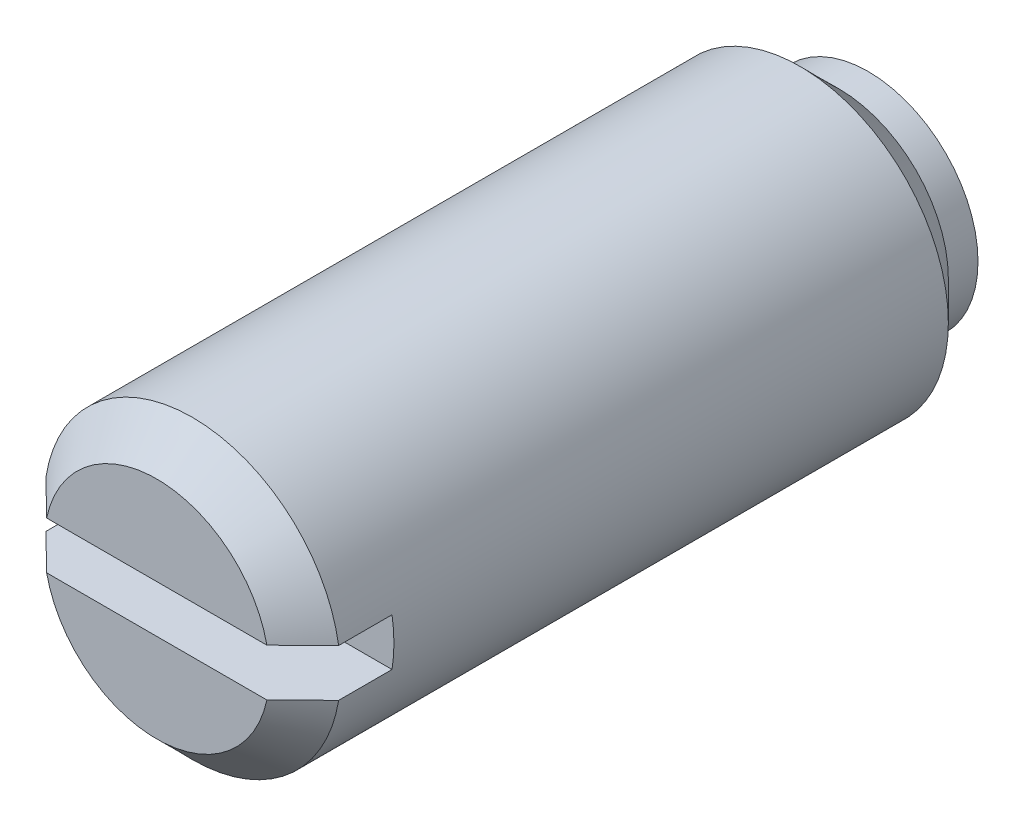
ISO-10303-21;
HEADER;
FILE_DESCRIPTION(('STEP AP214'),'2;1');
FILE_NAME('part.step','',(''),(''),'','','');
FILE_SCHEMA(('AUTOMOTIVE_DESIGN { 1 0 10303 214 1 1 1 1 }'));
ENDSEC;
DATA;
#1=APPLICATION_CONTEXT('core data for automotive mechanical design processes');
#2=APPLICATION_PROTOCOL_DEFINITION('international standard','automotive_design',2000,#1);
#3=PRODUCT_CONTEXT('',#1,'mechanical');
#4=PRODUCT('Part','Part','',(#3));
#5=PRODUCT_RELATED_PRODUCT_CATEGORY('part','',(#4));
#6=PRODUCT_DEFINITION_FORMATION('','',#4);
#7=PRODUCT_DEFINITION_CONTEXT('part definition',#1,'design');
#8=PRODUCT_DEFINITION('design','',#6,#7);
#9=PRODUCT_DEFINITION_SHAPE('','',#8);
#10=(LENGTH_UNIT() NAMED_UNIT(*) SI_UNIT(.MILLI.,.METRE.));
#11=(NAMED_UNIT(*) PLANE_ANGLE_UNIT() SI_UNIT($,.RADIAN.));
#12=(NAMED_UNIT(*) SI_UNIT($,.STERADIAN.) SOLID_ANGLE_UNIT());
#13=UNCERTAINTY_MEASURE_WITH_UNIT(LENGTH_MEASURE(1.E-05),#10,'distance_accuracy_value','');
#14=(GEOMETRIC_REPRESENTATION_CONTEXT(3) GLOBAL_UNCERTAINTY_ASSIGNED_CONTEXT((#13)) GLOBAL_UNIT_ASSIGNED_CONTEXT((#10,
#11,#12)) REPRESENTATION_CONTEXT('',''));
#15=CARTESIAN_POINT('',(0.,0.,0.));
#16=DIRECTION('',(0.,0.,1.));
#17=DIRECTION('',(1.,0.,0.));
#18=AXIS2_PLACEMENT_3D('',#15,#16,#17);
#19=CARTESIAN_POINT('',(0.,0.,-7.1));
#20=DIRECTION('',(0.,0.,-1.));
#21=DIRECTION('',(-1.,0.,0.));
#22=AXIS2_PLACEMENT_3D('',#19,#20,#21);
#23=CYLINDRICAL_SURFACE('',#22,2.5);
#24=CARTESIAN_POINT('',(0.,0.,11.4));
#25=DIRECTION('',(0.,0.,1.));
#26=DIRECTION('',(1.,0.,0.));
#27=AXIS2_PLACEMENT_3D('',#24,#25,#26);
#28=CIRCLE('',#27,2.5);
#29=CARTESIAN_POINT('',(-2.46779253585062,0.4,11.4));
#30=VERTEX_POINT('',#29);
#31=CARTESIAN_POINT('',(-2.46779253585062,-0.4,11.4));
#32=VERTEX_POINT('',#31);
#33=EDGE_CURVE('E70',#30,#32,#28,.T.);
#34=ORIENTED_EDGE('',*,*,#33,.F.);
#35=DIRECTION('',(0.,0.,1.));
#36=VECTOR('',#35,1.);
#37=CARTESIAN_POINT('',(-2.46779253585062,0.4,10.9));
#38=LINE('',#37,#36);
#39=CARTESIAN_POINT('',(-2.46779253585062,0.4,12.3));
#40=VERTEX_POINT('',#39);
#41=EDGE_CURVE('E30',#30,#40,#38,.T.);
#42=ORIENTED_EDGE('',*,*,#41,.T.);
#43=CARTESIAN_POINT('',(0.,0.,12.3));
#44=DIRECTION('',(0.,0.,1.));
#45=DIRECTION('',(1.,0.,0.));
#46=AXIS2_PLACEMENT_3D('',#43,#44,#45);
#47=CIRCLE('',#46,2.5);
#48=CARTESIAN_POINT('',(2.46779253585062,0.4,12.3));
#49=VERTEX_POINT('',#48);
#50=EDGE_CURVE('E67',#40,#49,#47,.F.);
#51=ORIENTED_EDGE('',*,*,#50,.T.);
#52=DIRECTION('',(0.,0.,1.));
#53=VECTOR('',#52,1.);
#54=CARTESIAN_POINT('',(2.46779253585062,0.4,10.9));
#55=LINE('',#54,#53);
#56=CARTESIAN_POINT('',(2.46779253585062,0.4,11.4));
#57=VERTEX_POINT('',#56);
#58=EDGE_CURVE('E72',#57,#49,#55,.T.);
#59=ORIENTED_EDGE('',*,*,#58,.F.);
#60=CARTESIAN_POINT('',(0.,0.,11.4));
#61=DIRECTION('',(0.,0.,1.));
#62=DIRECTION('',(1.,0.,0.));
#63=AXIS2_PLACEMENT_3D('',#60,#61,#62);
#64=CIRCLE('',#63,2.5);
#65=CARTESIAN_POINT('',(2.46779253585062,-0.4,11.4));
#66=VERTEX_POINT('',#65);
#67=EDGE_CURVE('E149',#66,#57,#64,.T.);
#68=ORIENTED_EDGE('',*,*,#67,.F.);
#69=DIRECTION('',(0.,0.,1.));
#70=VECTOR('',#69,1.);
#71=CARTESIAN_POINT('',(2.46779253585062,-0.4,10.9));
#72=LINE('',#71,#70);
#73=CARTESIAN_POINT('',(2.46779253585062,-0.4,12.3));
#74=VERTEX_POINT('',#73);
#75=EDGE_CURVE('E138',#66,#74,#72,.T.);
#76=ORIENTED_EDGE('',*,*,#75,.T.);
#77=CARTESIAN_POINT('',(0.,0.,12.3));
#78=DIRECTION('',(0.,0.,1.));
#79=DIRECTION('',(1.,0.,0.));
#80=AXIS2_PLACEMENT_3D('',#77,#78,#79);
#81=CIRCLE('',#80,2.5);
#82=CARTESIAN_POINT('',(-2.46779253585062,-0.4,12.3));
#83=VERTEX_POINT('',#82);
#84=EDGE_CURVE('E85',#74,#83,#81,.F.);
#85=ORIENTED_EDGE('',*,*,#84,.T.);
#86=DIRECTION('',(0.,0.,1.));
#87=VECTOR('',#86,1.);
#88=CARTESIAN_POINT('',(-2.46779253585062,-0.4,10.9));
#89=LINE('',#88,#87);
#90=EDGE_CURVE('E135',#32,#83,#89,.T.);
#91=ORIENTED_EDGE('',*,*,#90,.F.);
#92=EDGE_LOOP('',(#34,#42,#51,#59,#68,#76,#85,#91));
#93=FACE_BOUND('',#92,.T.);
#94=CARTESIAN_POINT('',(0.,0.,2.05));
#95=DIRECTION('',(0.,0.,1.));
#96=DIRECTION('',(1.,0.,0.));
#97=AXIS2_PLACEMENT_3D('',#94,#95,#96);
#98=CIRCLE('',#97,2.5);
#99=CARTESIAN_POINT('',(2.5,0.,2.05));
#100=VERTEX_POINT('',#99);
#101=EDGE_CURVE('E262',#100,#100,#98,.T.);
#102=ORIENTED_EDGE('',*,*,#101,.T.);
#103=EDGE_LOOP('',(#102));
#104=FACE_BOUND('',#103,.T.);
#105=ADVANCED_FACE('F14',(#93,#104),#23,.T.);
#106=CARTESIAN_POINT('',(0.,2.5,12.9));
#107=DIRECTION('',(0.,0.,1.));
#108=DIRECTION('',(1.,0.,0.));
#109=AXIS2_PLACEMENT_3D('',#106,#107,#108);
#110=PLANE('',#109);
#111=DIRECTION('',(1.,0.,0.));
#112=VECTOR('',#111,1.);
#113=CARTESIAN_POINT('',(-2.46779253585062,0.4,12.9));
#114=LINE('',#113,#112);
#115=CARTESIAN_POINT('',(-1.85741756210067,0.4,12.9));
#116=VERTEX_POINT('',#115);
#117=CARTESIAN_POINT('',(1.85741756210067,0.4,12.9));
#118=VERTEX_POINT('',#117);
#119=EDGE_CURVE('E79',#116,#118,#114,.T.);
#120=ORIENTED_EDGE('',*,*,#119,.T.);
#121=CARTESIAN_POINT('',(0.,0.,12.9));
#122=DIRECTION('',(0.,0.,1.));
#123=DIRECTION('',(1.,0.,0.));
#124=AXIS2_PLACEMENT_3D('',#121,#122,#123);
#125=CIRCLE('',#124,1.9);
#126=EDGE_CURVE('E9',#118,#116,#125,.T.);
#127=ORIENTED_EDGE('',*,*,#126,.T.);
#128=EDGE_LOOP('',(#120,#127));
#129=FACE_BOUND('',#128,.T.);
#130=ADVANCED_FACE('F134',(#129),#110,.T.);
#131=DIRECTION('',(1.,0.,0.));
#132=VECTOR('',#131,1.);
#133=CARTESIAN_POINT('',(-2.46779253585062,-0.4,12.9));
#134=LINE('',#133,#132);
#135=CARTESIAN_POINT('',(-1.85741756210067,-0.4,12.9));
#136=VERTEX_POINT('',#135);
#137=CARTESIAN_POINT('',(1.85741756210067,-0.4,12.9));
#138=VERTEX_POINT('',#137);
#139=EDGE_CURVE('E136',#136,#138,#134,.T.);
#140=ORIENTED_EDGE('',*,*,#139,.F.);
#141=CARTESIAN_POINT('',(0.,0.,12.9));
#142=DIRECTION('',(0.,0.,1.));
#143=DIRECTION('',(1.,0.,0.));
#144=AXIS2_PLACEMENT_3D('',#141,#142,#143);
#145=CIRCLE('',#144,1.9);
#146=EDGE_CURVE('E82',#136,#138,#145,.T.);
#147=ORIENTED_EDGE('',*,*,#146,.T.);
#148=EDGE_LOOP('',(#140,#147));
#149=FACE_BOUND('',#148,.T.);
#150=ADVANCED_FACE('F121',(#149),#110,.T.);
#151=CARTESIAN_POINT('',(-2.46779253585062,0.4,10.9));
#152=DIRECTION('',(0.,-1.,0.));
#153=DIRECTION('',(1.,0.,0.));
#154=AXIS2_PLACEMENT_3D('',#151,#152,#153);
#155=PLANE('',#154);
#156=DIRECTION('',(-1.,0.,0.));
#157=VECTOR('',#156,1.);
#158=CARTESIAN_POINT('',(2.46779253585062,0.4,11.4));
#159=LINE('',#158,#157);
#160=EDGE_CURVE('E34',#57,#30,#159,.T.);
#161=ORIENTED_EDGE('',*,*,#160,.F.);
#162=ORIENTED_EDGE('',*,*,#58,.T.);
#163=CARTESIAN_POINT('',(2.46779253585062,0.4,12.3));
#164=CARTESIAN_POINT('',(2.41703205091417,0.4,12.3501058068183));
#165=CARTESIAN_POINT('',(2.36625249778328,0.4,12.400192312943));
#166=CARTESIAN_POINT('',(2.26464552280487,0.4,12.5003166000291));
#167=CARTESIAN_POINT('',(2.21381810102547,0.4,12.5503543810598));
#168=CARTESIAN_POINT('',(2.11210548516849,0.4,12.650371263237));
#169=CARTESIAN_POINT('',(2.0612202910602,0.4,12.7003503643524));
#170=CARTESIAN_POINT('',(1.95937717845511,0.4,12.8002345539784));
#171=CARTESIAN_POINT('',(1.90841925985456,0.4,12.8501396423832));
#172=CARTESIAN_POINT('',(1.85741756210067,0.4,12.9));
#173=B_SPLINE_CURVE_WITH_KNOTS('',3,(#163,#164,#165,#166,#167,#168,#169,#170,#171,#172),
.UNSPECIFIED.,.F.,.F.,(4,2,2,2,4),(0.,0.213974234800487,0.42794816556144,0.641922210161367,
0.855896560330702),.UNSPECIFIED.);
#174=EDGE_CURVE('E23',#49,#118,#173,.T.);
#175=ORIENTED_EDGE('',*,*,#174,.T.);
#176=ORIENTED_EDGE('',*,*,#119,.F.);
#177=CARTESIAN_POINT('',(-1.85741756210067,0.4,12.9));
#178=CARTESIAN_POINT('',(-1.90841925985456,0.4,12.8501396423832));
#179=CARTESIAN_POINT('',(-1.95937717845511,0.4,12.8002345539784));
#180=CARTESIAN_POINT('',(-2.0612202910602,0.4,12.7003503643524));
#181=CARTESIAN_POINT('',(-2.11210548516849,0.4,12.650371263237));
#182=CARTESIAN_POINT('',(-2.21381810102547,0.4,12.5503543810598));
#183=CARTESIAN_POINT('',(-2.26464552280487,0.4,12.5003166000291));
#184=CARTESIAN_POINT('',(-2.36625249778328,0.4,12.400192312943));
#185=CARTESIAN_POINT('',(-2.41703205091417,0.4,12.3501058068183));
#186=CARTESIAN_POINT('',(-2.46779253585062,0.4,12.3));
#187=B_SPLINE_CURVE_WITH_KNOTS('',3,(#177,#178,#179,#180,#181,#182,#183,#184,#185,#186),
.UNSPECIFIED.,.F.,.F.,(4,2,2,2,4),(0.,0.213974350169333,0.427948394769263,0.641922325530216,
0.855896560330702),.UNSPECIFIED.);
#188=EDGE_CURVE('E76',#116,#40,#187,.T.);
#189=ORIENTED_EDGE('',*,*,#188,.T.);
#190=ORIENTED_EDGE('',*,*,#41,.F.);
#191=EDGE_LOOP('',(#161,#162,#175,#176,#189,#190));
#192=FACE_BOUND('',#191,.T.);
#193=ADVANCED_FACE('F77',(#192),#155,.T.);
#194=CARTESIAN_POINT('',(-2.46779253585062,-0.4,10.9));
#195=DIRECTION('',(0.,-1.,0.));
#196=DIRECTION('',(1.,0.,0.));
#197=AXIS2_PLACEMENT_3D('',#194,#195,#196);
#198=PLANE('',#197);
#199=ORIENTED_EDGE('',*,*,#75,.F.);
#200=DIRECTION('',(1.,0.,0.));
#201=VECTOR('',#200,1.);
#202=CARTESIAN_POINT('',(-2.46779253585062,-0.4,11.4));
#203=LINE('',#202,#201);
#204=EDGE_CURVE('E256',#32,#66,#203,.T.);
#205=ORIENTED_EDGE('',*,*,#204,.F.);
#206=ORIENTED_EDGE('',*,*,#90,.T.);
#207=CARTESIAN_POINT('',(-2.46779253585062,-0.4,12.3));
#208=CARTESIAN_POINT('',(-2.41703205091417,-0.4,12.3501058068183));
#209=CARTESIAN_POINT('',(-2.36625249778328,-0.4,12.400192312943));
#210=CARTESIAN_POINT('',(-2.26464552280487,-0.4,12.5003166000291));
#211=CARTESIAN_POINT('',(-2.21381810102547,-0.4,12.5503543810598));
#212=CARTESIAN_POINT('',(-2.11210548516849,-0.4,12.650371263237));
#213=CARTESIAN_POINT('',(-2.0612202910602,-0.4,12.7003503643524));
#214=CARTESIAN_POINT('',(-1.95937717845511,-0.4,12.8002345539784));
#215=CARTESIAN_POINT('',(-1.90841925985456,-0.4,12.8501396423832));
#216=CARTESIAN_POINT('',(-1.85741756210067,-0.4,12.9));
#217=B_SPLINE_CURVE_WITH_KNOTS('',3,(#207,#208,#209,#210,#211,#212,#213,#214,#215,#216),
.UNSPECIFIED.,.F.,.F.,(4,2,2,2,4),(0.,0.213974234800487,0.42794816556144,0.641922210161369,
0.855896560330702),.UNSPECIFIED.);
#218=EDGE_CURVE('E100',#83,#136,#217,.T.);
#219=ORIENTED_EDGE('',*,*,#218,.T.);
#220=ORIENTED_EDGE('',*,*,#139,.T.);
#221=CARTESIAN_POINT('',(1.85741756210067,-0.4,12.9));
#222=CARTESIAN_POINT('',(1.90841925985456,-0.4,12.8501396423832));
#223=CARTESIAN_POINT('',(1.95937717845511,-0.4,12.8002345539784));
#224=CARTESIAN_POINT('',(2.0612202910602,-0.4,12.7003503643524));
#225=CARTESIAN_POINT('',(2.11210548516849,-0.4,12.650371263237));
#226=CARTESIAN_POINT('',(2.21381810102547,-0.4,12.5503543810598));
#227=CARTESIAN_POINT('',(2.26464552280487,-0.4,12.5003166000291));
#228=CARTESIAN_POINT('',(2.36625249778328,-0.4,12.400192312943));
#229=CARTESIAN_POINT('',(2.41703205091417,-0.4,12.3501058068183));
#230=CARTESIAN_POINT('',(2.46779253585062,-0.4,12.3));
#231=B_SPLINE_CURVE_WITH_KNOTS('',3,(#221,#222,#223,#224,#225,#226,#227,#228,#229,#230),
.UNSPECIFIED.,.F.,.F.,(4,2,2,2,4),(0.,0.213974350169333,0.427948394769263,0.641922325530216,
0.855896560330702),.UNSPECIFIED.);
#232=EDGE_CURVE('E88',#138,#74,#231,.T.);
#233=ORIENTED_EDGE('',*,*,#232,.T.);
#234=EDGE_LOOP('',(#199,#205,#206,#219,#220,#233));
#235=FACE_BOUND('',#234,.T.);
#236=ADVANCED_FACE('F109',(#235),#198,.F.);
#237=CARTESIAN_POINT('',(0.,0.,14.7408826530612));
#238=DIRECTION('',(0.,0.,1.));
#239=DIRECTION('',(1.,0.,0.));
#240=AXIS2_PLACEMENT_3D('',#237,#238,#239);
#241=CYLINDRICAL_SURFACE('',#240,1.85);
#242=CARTESIAN_POINT('',(0.,0.,0.9));
#243=DIRECTION('',(0.,0.,1.));
#244=DIRECTION('',(1.,0.,0.));
#245=AXIS2_PLACEMENT_3D('',#242,#243,#244);
#246=CIRCLE('',#245,1.85);
#247=CARTESIAN_POINT('',(1.85,0.,0.9));
#248=VERTEX_POINT('',#247);
#249=EDGE_CURVE('E141',#248,#248,#246,.T.);
#250=ORIENTED_EDGE('',*,*,#249,.T.);
#251=EDGE_LOOP('',(#250));
#252=FACE_BOUND('',#251,.T.);
#253=CARTESIAN_POINT('',(0.,0.,1.4));
#254=DIRECTION('',(0.,0.,1.));
#255=DIRECTION('',(1.,0.,0.));
#256=AXIS2_PLACEMENT_3D('',#253,#254,#255);
#257=CIRCLE('',#256,1.85);
#258=CARTESIAN_POINT('',(1.85,0.,1.4));
#259=VERTEX_POINT('',#258);
#260=EDGE_CURVE('E265',#259,#259,#257,.T.);
#261=ORIENTED_EDGE('',*,*,#260,.F.);
#262=EDGE_LOOP('',(#261));
#263=FACE_BOUND('',#262,.T.);
#264=ADVANCED_FACE('F114',(#252,#263),#241,.T.);
#265=CARTESIAN_POINT('',(0.,0.,2.05));
#266=DIRECTION('',(0.,0.,1.));
#267=DIRECTION('',(1.,0.,0.));
#268=AXIS2_PLACEMENT_3D('',#265,#266,#267);
#269=CONICAL_SURFACE('',#268,2.5,0.785398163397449);
#270=ORIENTED_EDGE('',*,*,#260,.T.);
#271=EDGE_LOOP('',(#270));
#272=FACE_BOUND('',#271,.T.);
#273=ORIENTED_EDGE('',*,*,#101,.F.);
#274=EDGE_LOOP('',(#273));
#275=FACE_BOUND('',#274,.T.);
#276=ADVANCED_FACE('F202',(#272,#275),#269,.T.);
#277=CARTESIAN_POINT('',(0.,0.,1.5));
#278=DIRECTION('',(-1.,0.,0.));
#279=DIRECTION('',(0.,0.,1.));
#280=AXIS2_PLACEMENT_3D('',#277,#278,#279);
#281=SPHERICAL_SURFACE('',#280,1.5);
#282=CARTESIAN_POINT('',(0.,0.,1.5));
#283=DIRECTION('',(0.,0.,-1.));
#284=DIRECTION('',(-1.,0.,0.));
#285=AXIS2_PLACEMENT_3D('',#282,#283,#284);
#286=SPHERICAL_SURFACE('',#285,1.5);
#287=CARTESIAN_POINT('',(0.,0.,0.9));
#288=DIRECTION('',(0.,0.,-1.));
#289=DIRECTION('',(-1.,0.,0.));
#290=AXIS2_PLACEMENT_3D('',#287,#288,#289);
#291=CIRCLE('',#290,1.37477270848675);
#292=CARTESIAN_POINT('',(-1.37477270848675,0.,0.9));
#293=VERTEX_POINT('',#292);
#294=EDGE_CURVE('E71',#293,#293,#291,.T.);
#295=ORIENTED_EDGE('',*,*,#294,.T.);
#296=EDGE_LOOP('',(#295));
#297=FACE_BOUND('',#296,.T.);
#298=ADVANCED_FACE('F211',(#297),#286,.T.);
#299=CARTESIAN_POINT('',(0.,1.37477270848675,0.9));
#300=DIRECTION('',(0.,0.,-1.));
#301=DIRECTION('',(-1.,0.,0.));
#302=AXIS2_PLACEMENT_3D('',#299,#300,#301);
#303=PLANE('',#302);
#304=ORIENTED_EDGE('',*,*,#294,.F.);
#305=EDGE_LOOP('',(#304));
#306=FACE_BOUND('',#305,.T.);
#307=ORIENTED_EDGE('',*,*,#249,.F.);
#308=EDGE_LOOP('',(#307));
#309=FACE_BOUND('',#308,.T.);
#310=ADVANCED_FACE('F122',(#306,#309),#303,.T.);
#311=CARTESIAN_POINT('',(0.,0.,12.3));
#312=DIRECTION('',(0.,0.,-1.));
#313=DIRECTION('',(-1.,0.,0.));
#314=AXIS2_PLACEMENT_3D('',#311,#312,#313);
#315=CONICAL_SURFACE('',#314,2.5,0.785398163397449);
#316=ORIENTED_EDGE('',*,*,#232,.F.);
#317=ORIENTED_EDGE('',*,*,#146,.F.);
#318=ORIENTED_EDGE('',*,*,#218,.F.);
#319=ORIENTED_EDGE('',*,*,#84,.F.);
#320=EDGE_LOOP('',(#316,#317,#318,#319));
#321=FACE_BOUND('',#320,.T.);
#322=ADVANCED_FACE('F106',(#321),#315,.T.);
#323=CARTESIAN_POINT('',(0.,0.,12.3));
#324=DIRECTION('',(0.,0.,-1.));
#325=DIRECTION('',(-1.,0.,0.));
#326=AXIS2_PLACEMENT_3D('',#323,#324,#325);
#327=CONICAL_SURFACE('',#326,2.5,0.785398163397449);
#328=ORIENTED_EDGE('',*,*,#188,.F.);
#329=ORIENTED_EDGE('',*,*,#126,.F.);
#330=ORIENTED_EDGE('',*,*,#174,.F.);
#331=ORIENTED_EDGE('',*,*,#50,.F.);
#332=EDGE_LOOP('',(#328,#329,#330,#331));
#333=FACE_BOUND('',#332,.T.);
#334=ADVANCED_FACE('F16',(#333),#327,.T.);
#335=CARTESIAN_POINT('',(0.,0.,11.4));
#336=DIRECTION('',(0.,0.,1.));
#337=DIRECTION('',(1.,0.,0.));
#338=AXIS2_PLACEMENT_3D('',#335,#336,#337);
#339=PLANE('',#338);
#340=ORIENTED_EDGE('',*,*,#33,.T.);
#341=ORIENTED_EDGE('',*,*,#204,.T.);
#342=ORIENTED_EDGE('',*,*,#67,.T.);
#343=ORIENTED_EDGE('',*,*,#160,.T.);
#344=EDGE_LOOP('',(#340,#341,#342,#343));
#345=FACE_BOUND('',#344,.T.);
#346=ADVANCED_FACE('F243',(#345),#339,.T.);
#347=CLOSED_SHELL('',(#105,#130,#150,#193,#236,#264,#276,#298,#310,#322,#334,#346));
#348=MANIFOLD_SOLID_BREP('B1',#347);
#349=ADVANCED_BREP_SHAPE_REPRESENTATION('',(#18,#348),#14);
#350=SHAPE_DEFINITION_REPRESENTATION(#9,#349);
ENDSEC;
END-ISO-10303-21;
